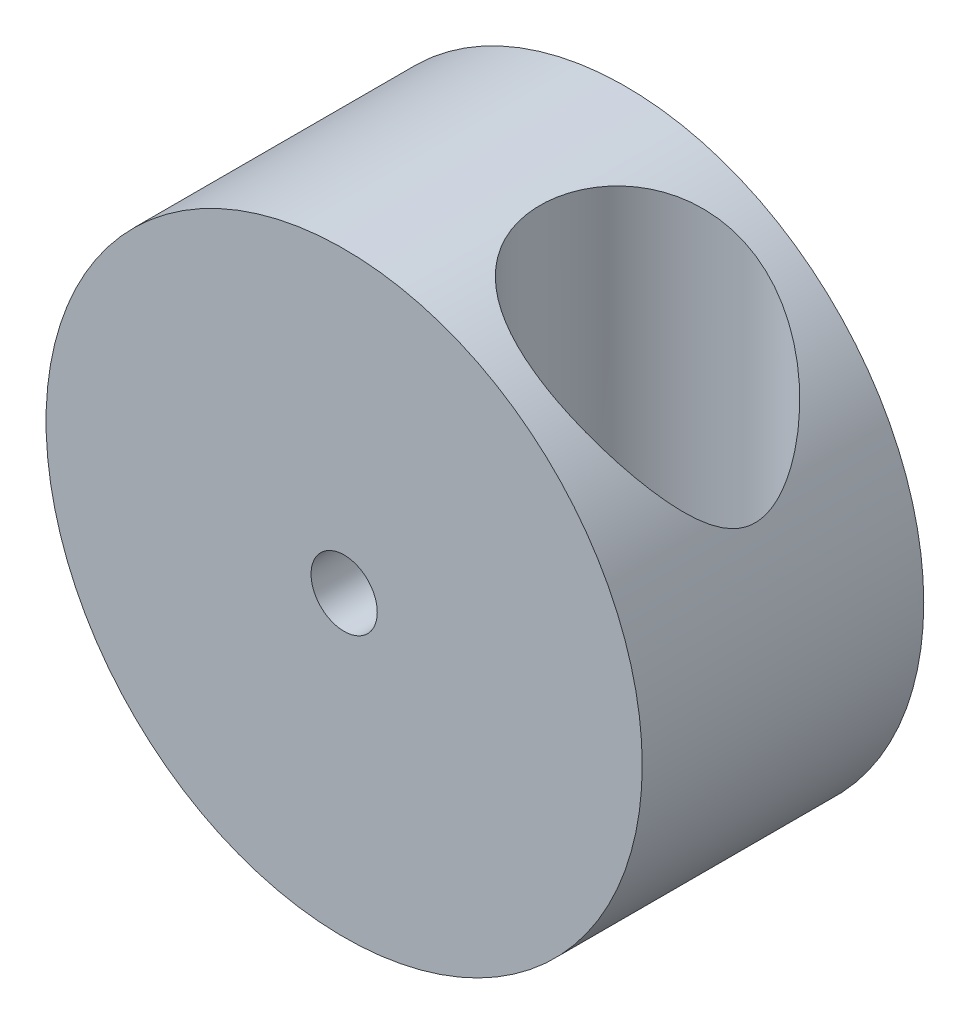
ISO-10303-21;
HEADER;
FILE_DESCRIPTION(('STEP AP214'),'2;1');
FILE_NAME('part.step','',(''),(''),'','','');
FILE_SCHEMA(('AUTOMOTIVE_DESIGN { 1 0 10303 214 1 1 1 1 }'));
ENDSEC;
DATA;
#1=APPLICATION_CONTEXT('core data for automotive mechanical design processes');
#2=APPLICATION_PROTOCOL_DEFINITION('international standard','automotive_design',2000,#1);
#3=PRODUCT_CONTEXT('',#1,'mechanical');
#4=PRODUCT('Part','Part','',(#3));
#5=PRODUCT_RELATED_PRODUCT_CATEGORY('part','',(#4));
#6=PRODUCT_DEFINITION_FORMATION('','',#4);
#7=PRODUCT_DEFINITION_CONTEXT('part definition',#1,'design');
#8=PRODUCT_DEFINITION('design','',#6,#7);
#9=PRODUCT_DEFINITION_SHAPE('','',#8);
#10=(LENGTH_UNIT() NAMED_UNIT(*) SI_UNIT(.MILLI.,.METRE.));
#11=(NAMED_UNIT(*) PLANE_ANGLE_UNIT() SI_UNIT($,.RADIAN.));
#12=(NAMED_UNIT(*) SI_UNIT($,.STERADIAN.) SOLID_ANGLE_UNIT());
#13=UNCERTAINTY_MEASURE_WITH_UNIT(LENGTH_MEASURE(1.E-05),#10,'distance_accuracy_value','');
#14=(GEOMETRIC_REPRESENTATION_CONTEXT(3) GLOBAL_UNCERTAINTY_ASSIGNED_CONTEXT((#13)) GLOBAL_UNIT_ASSIGNED_CONTEXT((#10,
#11,#12)) REPRESENTATION_CONTEXT('',''));
#15=CARTESIAN_POINT('',(0.,0.,0.));
#16=DIRECTION('',(0.,0.,1.));
#17=DIRECTION('',(1.,0.,0.));
#18=AXIS2_PLACEMENT_3D('',#15,#16,#17);
#19=CARTESIAN_POINT('',(0.,0.,8.5));
#20=DIRECTION('',(0.,0.,-1.));
#21=DIRECTION('',(-1.,0.,0.));
#22=AXIS2_PLACEMENT_3D('',#19,#20,#21);
#23=CYLINDRICAL_SURFACE('',#22,18.);
#24=CARTESIAN_POINT('',(0.,0.,-8.5));
#25=DIRECTION('',(0.,0.,1.));
#26=DIRECTION('',(1.,0.,0.));
#27=AXIS2_PLACEMENT_3D('',#24,#25,#26);
#28=CIRCLE('',#27,18.);
#29=CARTESIAN_POINT('',(18.,0.,-8.5));
#30=VERTEX_POINT('',#29);
#31=EDGE_CURVE('E24',#30,#30,#28,.T.);
#32=ORIENTED_EDGE('',*,*,#31,.T.);
#33=EDGE_LOOP('',(#32));
#34=FACE_BOUND('',#33,.T.);
#35=CARTESIAN_POINT('',(0.,0.,8.5));
#36=DIRECTION('',(0.,0.,1.));
#37=DIRECTION('',(1.,0.,0.));
#38=AXIS2_PLACEMENT_3D('',#35,#36,#37);
#39=CIRCLE('',#38,18.);
#40=CARTESIAN_POINT('',(18.,0.,8.5));
#41=VERTEX_POINT('',#40);
#42=EDGE_CURVE('E8',#41,#41,#39,.T.);
#43=ORIENTED_EDGE('',*,*,#42,.F.);
#44=EDGE_LOOP('',(#43));
#45=FACE_BOUND('',#44,.T.);
#46=CARTESIAN_POINT('',(9.82111739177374,15.0846164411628,-6.5));
#47=CARTESIAN_POINT('',(9.6503136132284,15.1958214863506,-6.4999999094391));
#48=CARTESIAN_POINT('',(9.47761141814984,15.304124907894,-6.49326607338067));
#49=CARTESIAN_POINT('',(9.12941892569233,15.5143504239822,-6.46545113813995));
#50=CARTESIAN_POINT('',(8.95392798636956,15.616271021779,-6.44436668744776));
#51=CARTESIAN_POINT('',(8.60136026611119,15.8132032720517,-6.3870266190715));
#52=CARTESIAN_POINT('',(8.42428243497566,15.9082099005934,-6.35076009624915));
#53=CARTESIAN_POINT('',(8.07020637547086,16.0907250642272,-6.2623955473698));
#54=CARTESIAN_POINT('',(7.89320814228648,16.1782341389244,-6.21029866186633));
#55=CARTESIAN_POINT('',(7.53997028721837,16.3458646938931,-6.0894511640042));
#56=CARTESIAN_POINT('',(7.36374148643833,16.42593899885,-6.02060307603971));
#57=CARTESIAN_POINT('',(7.01506082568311,16.5778493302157,-5.86620804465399));
#58=CARTESIAN_POINT('',(6.84260909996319,16.6496850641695,-5.78066050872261));
#59=CARTESIAN_POINT('',(6.50364285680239,16.7849909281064,-5.5930196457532));
#60=CARTESIAN_POINT('',(6.33712527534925,16.848465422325,-5.49093501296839));
#61=CARTESIAN_POINT('',(6.01203414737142,16.967185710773,-5.27061932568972));
#62=CARTESIAN_POINT('',(5.85345976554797,17.0224323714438,-5.15238997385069));
#63=CARTESIAN_POINT('',(5.56199214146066,17.1197369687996,-4.91341613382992));
#64=CARTESIAN_POINT('',(5.42813040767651,17.1625657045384,-4.79416293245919));
#65=CARTESIAN_POINT('',(5.16983004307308,17.2421321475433,-4.54399008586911));
#66=CARTESIAN_POINT('',(5.04539102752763,17.2788701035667,-4.41307091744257));
#67=CARTESIAN_POINT('',(4.80722303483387,17.3466406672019,-4.1404854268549));
#68=CARTESIAN_POINT('',(4.69349293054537,17.377673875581,-3.99882023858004));
#69=CARTESIAN_POINT('',(4.47786120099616,17.4344829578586,-3.7057666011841));
#70=CARTESIAN_POINT('',(4.37595950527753,17.4602588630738,-3.55437820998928));
#71=CARTESIAN_POINT('',(4.18866438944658,17.5061140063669,-3.24904640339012));
#72=CARTESIAN_POINT('',(4.1027851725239,17.5263749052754,-3.09542784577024));
#73=CARTESIAN_POINT('',(3.94358218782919,17.5628823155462,-2.7812939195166));
#74=CARTESIAN_POINT('',(3.8702626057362,17.5791274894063,-2.62077627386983));
#75=CARTESIAN_POINT('',(3.73685348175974,17.6079693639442,-2.29409076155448));
#76=CARTESIAN_POINT('',(3.67675893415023,17.620567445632,-2.12792506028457));
#77=CARTESIAN_POINT('',(3.5702312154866,17.6424604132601,-1.79099194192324));
#78=CARTESIAN_POINT('',(3.52380311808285,17.651754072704,-1.62022284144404));
#79=CARTESIAN_POINT('',(3.44473877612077,17.6673544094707,-1.27417000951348));
#80=CARTESIAN_POINT('',(3.41219785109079,17.6736404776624,-1.09886356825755));
#81=CARTESIAN_POINT('',(3.36162001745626,17.6833304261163,-0.746087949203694));
#82=CARTESIAN_POINT('',(3.34358350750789,17.6867342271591,-0.56861871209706));
#83=CARTESIAN_POINT('',(3.32215527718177,17.6907717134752,-0.212759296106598));
#84=CARTESIAN_POINT('',(3.31876418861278,17.6914052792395,-0.0343690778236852));
#85=CARTESIAN_POINT('',(3.32665463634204,17.6899232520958,0.322075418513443));
#86=CARTESIAN_POINT('',(3.33793621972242,17.6878076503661,0.500129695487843));
#87=CARTESIAN_POINT('',(3.37521452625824,17.6807321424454,0.855889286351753));
#88=CARTESIAN_POINT('',(3.40131312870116,17.6757525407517,1.03358354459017));
#89=CARTESIAN_POINT('',(3.46809272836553,17.6627712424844,1.38609437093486));
#90=CARTESIAN_POINT('',(3.50877338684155,17.654769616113,1.5609110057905));
#91=CARTESIAN_POINT('',(3.60439929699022,17.6354949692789,1.90645152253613));
#92=CARTESIAN_POINT('',(3.65934731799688,17.6242213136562,2.07717460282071));
#93=CARTESIAN_POINT('',(3.7830281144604,17.5980876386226,2.4131964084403));
#94=CARTESIAN_POINT('',(3.85175564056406,17.583228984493,2.57849717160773));
#95=CARTESIAN_POINT('',(4.0022417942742,17.5495865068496,2.90214698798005));
#96=CARTESIAN_POINT('',(4.0839681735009,17.5308123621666,3.06051203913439));
#97=CARTESIAN_POINT('',(4.2598260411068,17.4889120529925,3.3695144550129));
#98=CARTESIAN_POINT('',(4.35395277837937,17.4657875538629,3.52015474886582));
#99=CARTESIAN_POINT('',(4.5537912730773,17.4147528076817,3.81269658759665));
#100=CARTESIAN_POINT('',(4.65950350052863,17.3868423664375,3.95459777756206));
#101=CARTESIAN_POINT('',(4.8815249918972,17.3258177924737,4.2286553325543));
#102=CARTESIAN_POINT('',(4.9978341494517,17.2927037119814,4.36081179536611));
#103=CARTESIAN_POINT('',(5.23872335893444,17.2212484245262,4.61321952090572));
#104=CARTESIAN_POINT('',(5.36320893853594,17.1829628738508,4.73357673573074));
#105=CARTESIAN_POINT('',(5.62028395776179,17.1006029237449,4.96313347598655));
#106=CARTESIAN_POINT('',(5.75287330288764,17.0565285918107,5.07233313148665));
#107=CARTESIAN_POINT('',(6.02486893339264,16.9623600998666,5.27898354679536));
#108=CARTESIAN_POINT('',(6.16427461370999,16.9122664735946,5.37643534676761));
#109=CARTESIAN_POINT('',(6.44858496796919,16.8059151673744,5.5591892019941));
#110=CARTESIAN_POINT('',(6.59348969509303,16.7496574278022,5.6444911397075));
#111=CARTESIAN_POINT('',(6.88863384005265,16.630461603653,5.80334844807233));
#112=CARTESIAN_POINT('',(7.0389067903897,16.5674734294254,5.8768038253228));
#113=CARTESIAN_POINT('',(7.34237868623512,16.4352329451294,6.01110652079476));
#114=CARTESIAN_POINT('',(7.49557882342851,16.3659780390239,6.07194857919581));
#115=CARTESIAN_POINT('',(7.80353286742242,16.2213996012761,6.18110335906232));
#116=CARTESIAN_POINT('',(7.95828657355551,16.1460768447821,6.22941767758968));
#117=CARTESIAN_POINT('',(8.26818575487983,15.9895979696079,6.31381025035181));
#118=CARTESIAN_POINT('',(8.42333126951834,15.9084412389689,6.34988721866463));
#119=CARTESIAN_POINT('',(8.74449944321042,15.7343424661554,6.41245830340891));
#120=CARTESIAN_POINT('',(8.91046881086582,15.6409729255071,6.43803516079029));
#121=CARTESIAN_POINT('',(9.24044476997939,15.4483232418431,6.47614158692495));
#122=CARTESIAN_POINT('',(9.40445131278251,15.3490429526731,6.48867083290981));
#123=CARTESIAN_POINT('',(9.72960728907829,15.1450187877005,6.50139294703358));
#124=CARTESIAN_POINT('',(9.89075539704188,15.0402724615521,6.50158023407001));
#125=CARTESIAN_POINT('',(10.2093439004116,14.8258623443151,6.49035419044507));
#126=CARTESIAN_POINT('',(10.3667836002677,14.7161976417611,6.47893870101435));
#127=CARTESIAN_POINT('',(10.7472030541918,14.4421105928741,6.4376739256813));
#128=CARTESIAN_POINT('',(10.9677989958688,14.2752516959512,6.40184157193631));
#129=CARTESIAN_POINT('',(11.3984629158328,13.9337952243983,6.3095578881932));
#130=CARTESIAN_POINT('',(11.6085268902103,13.7591947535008,6.25309878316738));
#131=CARTESIAN_POINT('',(12.0175167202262,13.40346460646,6.12144231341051));
#132=CARTESIAN_POINT('',(12.2164239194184,13.222324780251,6.04621464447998));
#133=CARTESIAN_POINT('',(12.6021655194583,12.8552061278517,5.87877392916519));
#134=CARTESIAN_POINT('',(12.7890011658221,12.6692278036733,5.78656263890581));
#135=CARTESIAN_POINT('',(13.1534762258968,12.2904975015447,5.58475901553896));
#136=CARTESIAN_POINT('',(13.3308991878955,12.0976839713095,5.47489228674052));
#137=CARTESIAN_POINT('',(13.6728330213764,11.7098452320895,5.23997381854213));
#138=CARTESIAN_POINT('',(13.8373423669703,11.5148197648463,5.11492028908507));
#139=CARTESIAN_POINT('',(14.1532191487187,11.1242717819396,4.85029123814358));
#140=CARTESIAN_POINT('',(14.3045953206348,10.9287496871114,4.71072550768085));
#141=CARTESIAN_POINT('',(14.5941743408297,10.5389262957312,4.41706513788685));
#142=CARTESIAN_POINT('',(14.7323806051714,10.3446246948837,4.26297428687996));
#143=CARTESIAN_POINT('',(14.9532075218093,10.0213127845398,3.99145084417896));
#144=CARTESIAN_POINT('',(15.039447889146,9.89133333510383,3.8780954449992));
#145=CARTESIAN_POINT('',(15.2055548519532,9.63402989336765,3.64395956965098));
#146=CARTESIAN_POINT('',(15.2854224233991,9.50670549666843,3.52318023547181));
#147=CARTESIAN_POINT('',(15.4384877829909,9.25605926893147,3.27361826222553));
#148=CARTESIAN_POINT('',(15.5116888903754,9.13273546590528,3.14483966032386));
#149=CARTESIAN_POINT('',(15.6509947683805,8.89189066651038,2.8783868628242));
#150=CARTESIAN_POINT('',(15.7171020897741,8.77436759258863,2.74071589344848));
#151=CARTESIAN_POINT('',(15.8594041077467,8.51509671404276,2.41439829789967));
#152=CARTESIAN_POINT('',(15.9330666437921,8.37604880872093,2.222443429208));
#153=CARTESIAN_POINT('',(16.0649495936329,8.12022219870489,1.81917322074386));
#154=CARTESIAN_POINT('',(16.123197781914,8.00340354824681,1.60789363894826));
#155=CARTESIAN_POINT('',(16.2056899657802,7.83465119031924,1.22994931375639));
#156=CARTESIAN_POINT('',(16.234896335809,7.77374032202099,1.06846461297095));
#157=CARTESIAN_POINT('',(16.2813852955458,7.67590138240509,0.736782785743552));
#158=CARTESIAN_POINT('',(16.2986903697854,7.63892809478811,0.566602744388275));
#159=CARTESIAN_POINT('',(16.3197302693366,7.59388636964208,0.219909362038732));
#160=CARTESIAN_POINT('',(16.323344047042,7.58607577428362,0.0433533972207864));
#161=CARTESIAN_POINT('',(16.3161940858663,7.60143720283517,-0.308128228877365));
#162=CARTESIAN_POINT('',(16.3054220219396,7.62462716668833,-0.483052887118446));
#163=CARTESIAN_POINT('',(16.2685999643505,7.70290035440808,-0.847123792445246));
#164=CARTESIAN_POINT('',(16.240791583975,7.76164305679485,-1.03527440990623));
#165=CARTESIAN_POINT('',(16.1715270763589,7.90493278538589,-1.3988494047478));
#166=CARTESIAN_POINT('',(16.1300371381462,7.98954370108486,-1.57424092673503));
#167=CARTESIAN_POINT('',(16.042912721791,8.16290248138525,-1.88723742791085));
#168=CARTESIAN_POINT('',(15.9987599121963,8.2492566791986,-2.02662703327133));
#169=CARTESIAN_POINT('',(15.9035295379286,8.43138862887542,-2.29668877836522));
#170=CARTESIAN_POINT('',(15.8524467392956,8.52717348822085,-2.42735421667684));
#171=CARTESIAN_POINT('',(15.7440563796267,8.72568107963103,-2.68101819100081));
#172=CARTESIAN_POINT('',(15.6867355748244,8.82841839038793,-2.80399950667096));
#173=CARTESIAN_POINT('',(15.5664647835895,9.03879928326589,-3.04283539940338));
#174=CARTESIAN_POINT('',(15.5035128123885,9.14644458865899,-3.15868743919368));
#175=CARTESIAN_POINT('',(15.3163004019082,9.45868465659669,-3.48015618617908));
#176=CARTESIAN_POINT('',(15.1856046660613,9.66754752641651,-3.67791518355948));
#177=CARTESIAN_POINT('',(14.9072860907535,10.0914485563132,-4.05408259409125));
#178=CARTESIAN_POINT('',(14.7596506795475,10.3064912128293,-4.23247644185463));
#179=CARTESIAN_POINT('',(14.4477449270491,10.7393644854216,-4.57136922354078));
#180=CARTESIAN_POINT('',(14.2834471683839,10.9571991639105,-4.73183771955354));
#181=CARTESIAN_POINT('',(13.938706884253,11.3925216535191,-5.03468598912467));
#182=CARTESIAN_POINT('',(13.7582691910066,11.6100095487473,-5.17707114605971));
#183=CARTESIAN_POINT('',(13.3735104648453,12.0514923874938,-5.4486904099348));
#184=CARTESIAN_POINT('',(13.1685092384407,12.2753830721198,-5.57713410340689));
#185=CARTESIAN_POINT('',(12.7412496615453,12.7183040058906,-5.81225312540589));
#186=CARTESIAN_POINT('',(12.5189857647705,12.937332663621,-5.91892141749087));
#187=CARTESIAN_POINT('',(12.0588501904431,13.3672293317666,-6.10770913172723));
#188=CARTESIAN_POINT('',(11.821054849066,13.5781301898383,-6.18993900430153));
#189=CARTESIAN_POINT('',(11.3301340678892,13.9903745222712,-6.32753841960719));
#190=CARTESIAN_POINT('',(11.0770237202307,14.1917270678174,-6.3829339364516));
#191=CARTESIAN_POINT('',(10.6560038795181,14.508284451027,-6.44822181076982));
#192=CARTESIAN_POINT('',(10.492248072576,14.6271620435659,-6.46740564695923));
#193=CARTESIAN_POINT('',(10.1599992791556,14.8598635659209,-6.49329937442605));
#194=CARTESIAN_POINT('',(9.99150290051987,14.9736837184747,-6.50000009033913));
#195=CARTESIAN_POINT('',(9.82111739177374,15.0846164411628,-6.5));
#196=B_SPLINE_CURVE_WITH_KNOTS('',3,(#46,#47,#48,#49,#50,#51,#52,#53,#54,#55,#56,#57,#58,#59,
#60,#61,#62,#63,#64,#65,#66,#67,#68,#69,#70,#71,#72,#73,#74,#75,#76,#77,#78,#79,#80,#81,#82,#83,
#84,#85,#86,#87,#88,#89,#90,#91,#92,#93,#94,#95,#96,#97,#98,#99,#100,#101,#102,#103,#104,#105,
#106,#107,#108,#109,#110,#111,#112,#113,#114,#115,#116,#117,#118,#119,#120,#121,#122,#123,#124,
#125,#126,#127,#128,#129,#130,#131,#132,#133,#134,#135,#136,#137,#138,#139,#140,#141,#142,#143,
#144,#145,#146,#147,#148,#149,#150,#151,#152,#153,#154,#155,#156,#157,#158,#159,#160,#161,#162,
#163,#164,#165,#166,#167,#168,#169,#170,#171,#172,#173,#174,#175,#176,#177,#178,#179,#180,#181,
#182,#183,#184,#185,#186,#187,#188,#189,#190,#191,#192,#193,#194,#195),.UNSPECIFIED.,.T.,.F.,(4,
2,2,2,2,2,2,2,2,2,2,2,2,2,2,2,2,2,2,2,2,2,2,2,2,2,2,2,2,2,2,2,2,2,2,2,2,2,2,2,2,2,2,2,2,2,2,2,2,
2,2,2,2,2,2,2,2,2,2,2,2,2,2,2,2,2,2,2,2,2,2,2,2,2,4),(0.,0.611300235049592,1.22274328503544,
1.8346262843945,2.4464652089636,3.06195336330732,3.67746335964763,4.29265080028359,
4.90777341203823,5.46004540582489,6.01229483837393,6.56448608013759,7.11667403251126,
7.64752151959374,8.17854557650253,8.70936829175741,9.24038782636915,9.77499576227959,
10.3096183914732,10.84426408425,11.378911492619,11.917280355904,12.4556367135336,12.99409764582,
13.5323538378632,14.0692949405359,14.606030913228,15.1427886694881,15.6795410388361,
16.2109191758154,16.7422911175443,17.2736159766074,17.8049459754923,18.3405493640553,
18.8763756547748,19.4121336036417,19.9479478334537,20.5237912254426,21.0996488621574,
21.6757669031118,22.2519921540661,23.0874831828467,23.9232894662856,24.7604540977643,
25.5975322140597,26.4491686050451,27.3009054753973,28.1520713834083,29.0030159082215,
29.5812612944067,30.1594179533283,30.7372851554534,31.3149438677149,32.0580177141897,
32.7997433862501,33.3230793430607,33.8454238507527,34.3723758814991,34.8996329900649,
35.4935085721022,36.088862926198,36.5975827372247,37.1066889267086,37.6168978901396,
38.1272873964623,39.0736627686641,40.0207450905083,40.9694119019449,41.9177956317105,
42.9055153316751,43.8935536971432,44.8770561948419,45.859604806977,46.4689603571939,
47.0787636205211),.UNSPECIFIED.);
#197=CARTESIAN_POINT('',(9.82111739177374,15.0846164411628,-6.5));
#198=VERTEX_POINT('',#197);
#199=EDGE_CURVE('E16',#198,#198,#196,.T.);
#200=ORIENTED_EDGE('',*,*,#199,.F.);
#201=EDGE_LOOP('',(#200));
#202=FACE_BOUND('',#201,.T.);
#203=ADVANCED_FACE('F12',(#34,#45,#202),#23,.T.);
#204=CARTESIAN_POINT('',(0.,0.,8.5));
#205=DIRECTION('',(0.,0.,1.));
#206=DIRECTION('',(1.,0.,0.));
#207=AXIS2_PLACEMENT_3D('',#204,#205,#206);
#208=PLANE('',#207);
#209=ORIENTED_EDGE('',*,*,#42,.T.);
#210=EDGE_LOOP('',(#209));
#211=FACE_BOUND('',#210,.T.);
#212=CARTESIAN_POINT('',(0.,0.,8.5));
#213=DIRECTION('',(0.,0.,1.));
#214=DIRECTION('',(1.,0.,0.));
#215=AXIS2_PLACEMENT_3D('',#212,#213,#214);
#216=CIRCLE('',#215,2.);
#217=CARTESIAN_POINT('',(2.,0.,8.5));
#218=VERTEX_POINT('',#217);
#219=EDGE_CURVE('E29',#218,#218,#216,.T.);
#220=ORIENTED_EDGE('',*,*,#219,.F.);
#221=EDGE_LOOP('',(#220));
#222=FACE_BOUND('',#221,.T.);
#223=ADVANCED_FACE('F46',(#211,#222),#208,.T.);
#224=CARTESIAN_POINT('',(0.,0.,-8.5));
#225=DIRECTION('',(0.,0.,1.));
#226=DIRECTION('',(1.,0.,0.));
#227=AXIS2_PLACEMENT_3D('',#224,#225,#226);
#228=PLANE('',#227);
#229=ORIENTED_EDGE('',*,*,#31,.F.);
#230=EDGE_LOOP('',(#229));
#231=FACE_BOUND('',#230,.T.);
#232=CARTESIAN_POINT('',(0.,0.,-8.5));
#233=DIRECTION('',(0.,0.,1.));
#234=DIRECTION('',(1.,0.,0.));
#235=AXIS2_PLACEMENT_3D('',#232,#233,#234);
#236=CIRCLE('',#235,2.);
#237=CARTESIAN_POINT('',(2.,0.,-8.5));
#238=VERTEX_POINT('',#237);
#239=EDGE_CURVE('E31',#238,#238,#236,.T.);
#240=ORIENTED_EDGE('',*,*,#239,.T.);
#241=EDGE_LOOP('',(#240));
#242=FACE_BOUND('',#241,.T.);
#243=ADVANCED_FACE('F53',(#231,#242),#228,.F.);
#244=CARTESIAN_POINT('',(0.,0.,8.5));
#245=DIRECTION('',(0.,0.,-1.));
#246=DIRECTION('',(-1.,0.,0.));
#247=AXIS2_PLACEMENT_3D('',#244,#245,#246);
#248=CYLINDRICAL_SURFACE('',#247,2.);
#249=ORIENTED_EDGE('',*,*,#219,.T.);
#250=EDGE_LOOP('',(#249));
#251=FACE_BOUND('',#250,.T.);
#252=ORIENTED_EDGE('',*,*,#239,.F.);
#253=EDGE_LOOP('',(#252));
#254=FACE_BOUND('',#253,.T.);
#255=ADVANCED_FACE('F60',(#251,#254),#248,.F.);
#256=CARTESIAN_POINT('',(9.82111739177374,22.,0.));
#257=DIRECTION('',(0.,-1.,0.));
#258=DIRECTION('',(0.,0.,-1.));
#259=AXIS2_PLACEMENT_3D('',#256,#257,#258);
#260=CYLINDRICAL_SURFACE('',#259,6.5);
#261=CARTESIAN_POINT('',(9.82111739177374,-5.,0.));
#262=DIRECTION('',(0.,1.,0.));
#263=DIRECTION('',(0.,0.,1.));
#264=AXIS2_PLACEMENT_3D('',#261,#262,#263);
#265=CIRCLE('',#264,6.5);
#266=CARTESIAN_POINT('',(9.82111739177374,-5.,6.5));
#267=VERTEX_POINT('',#266);
#268=EDGE_CURVE('E36',#267,#267,#265,.T.);
#269=ORIENTED_EDGE('',*,*,#268,.F.);
#270=EDGE_LOOP('',(#269));
#271=FACE_BOUND('',#270,.T.);
#272=ORIENTED_EDGE('',*,*,#199,.T.);
#273=EDGE_LOOP('',(#272));
#274=FACE_BOUND('',#273,.T.);
#275=ADVANCED_FACE('F43',(#271,#274),#260,.F.);
#276=CARTESIAN_POINT('',(9.82111739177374,-5.,0.));
#277=DIRECTION('',(0.,1.,0.));
#278=DIRECTION('',(0.,0.,1.));
#279=AXIS2_PLACEMENT_3D('',#276,#277,#278);
#280=PLANE('',#279);
#281=ORIENTED_EDGE('',*,*,#268,.T.);
#282=EDGE_LOOP('',(#281));
#283=FACE_BOUND('',#282,.T.);
#284=ADVANCED_FACE('F70',(#283),#280,.T.);
#285=CLOSED_SHELL('',(#203,#223,#243,#255,#275,#284));
#286=MANIFOLD_SOLID_BREP('B1',#285);
#287=ADVANCED_BREP_SHAPE_REPRESENTATION('',(#18,#286),#14);
#288=SHAPE_DEFINITION_REPRESENTATION(#9,#287);
ENDSEC;
END-ISO-10303-21;
